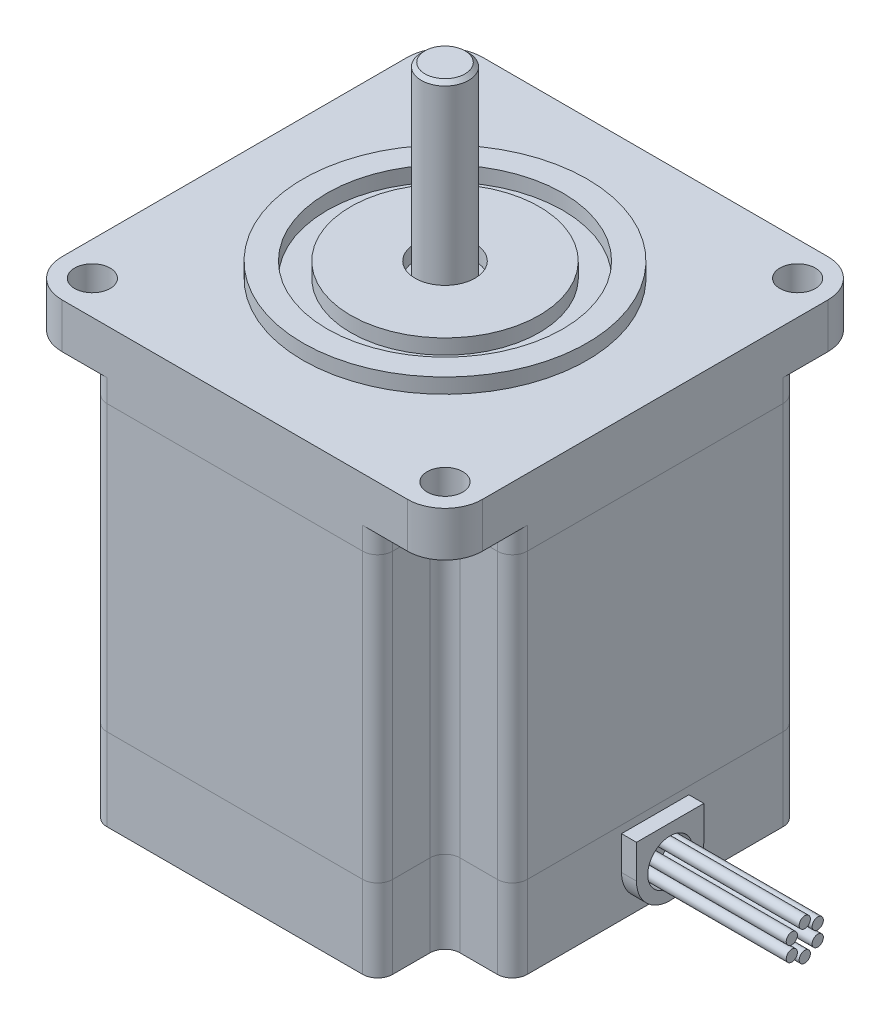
from build123d import *

# Parameters (mm, degrees)
SKETCH1_W             = 56.2
SKETCH1_H             = 56.2
SKETCH1_R             = 2.375
BOSS_EXTRUDE2_DEPTH   = 11
SKETCH2_W             = 56.2
SKETCH2_H             = 56.2
SKETCH2_R             = 2.375
BOSS_EXTRUDE3_DEPTH   = 38
SKETCH3_W             = 56.2
SKETCH3_H             = 56.2
SKETCH3_R             = 2.375
BOSS_EXTRUDE4_DEPTH   = 9
SKETCH4_R             = 3
BOSS_EXTRUDE5_DEPTH   = 2
SKETCH5_R             = 0.75
BOSS_EXTRUDE6_DEPTH   = 20
BOSS_EXTRUDE6_2_DEPTH = 20
BOSS_EXTRUDE6_3_DEPTH = 20
BOSS_EXTRUDE6_4_DEPTH = 20
BOSS_EXTRUDE6_5_DEPTH = 20
BOSS_EXTRUDE6_6_DEPTH = 20
SKETCH6_R             = 19
SKETCH6_R_2           = 15.75
SKETCH6_R_3           = 12.6
SKETCH6_R_4           = 4
BOSS_EXTRUDE7_DEPTH   = 2
SKETCH7_R             = 3.175
BOSS_EXTRUDE8_DEPTH   = 25
SKETCH11_W            = 9
SKETCH11_H            = 9
CUT_EXTRUDE1_DEPTH    = 52
FILLET1_R             = 5
FILLET2_R             = 2
FILLET3_R             = 2
CHAMFER1_SIZE         = 0.5
FILLET4_R             = 2


with BuildPart() as part:
    # Sketch1 → Boss-Extrude2 (new body)
    with BuildSketch(Plane(origin=(0, 0, 0), x_dir=(1, 0, 0), z_dir=(0, 1, 0))):
        Rectangle(SKETCH1_W, SKETCH1_H)
        with Locations(Location((23.57, 23.57, 0), (0, 0, 270))):
            Circle(SKETCH1_R, mode=Mode.SUBTRACT)
        with Locations(Location((23.57, -23.57, 0), (0, 0, 270))):
            Circle(SKETCH1_R, mode=Mode.SUBTRACT)
        with Locations(Location((-23.57, -23.57, 0), (0, 0, 270))):
            Circle(SKETCH1_R, mode=Mode.SUBTRACT)
        with Locations(Location((-23.57, 23.57, 0), (0, 0, 270))):
            Circle(SKETCH1_R, mode=Mode.SUBTRACT)
    extrude(amount=BOSS_EXTRUDE2_DEPTH)


with BuildPart() as body_2:
    # Sketch2 → Boss-Extrude3 (new body)
    with BuildSketch(Plane(origin=(0, 11, 0), x_dir=(1, 0, 0), z_dir=(0, 1, 0))):
        Rectangle(SKETCH2_W, SKETCH2_H)
        with Locations(Location((-23.57, -23.57, 0), (0, 0, 270))):
            Circle(SKETCH2_R, mode=Mode.SUBTRACT)
        with Locations(Location((23.57, -23.57, 0), (0, 0, 270))):
            Circle(SKETCH2_R, mode=Mode.SUBTRACT)
        with Locations(Location((23.57, 23.57, 0), (0, 0, 270))):
            Circle(SKETCH2_R, mode=Mode.SUBTRACT)
        with Locations(Location((-23.57, 23.57, 0), (0, 0, 270))):
            Circle(SKETCH2_R, mode=Mode.SUBTRACT)
    extrude(amount=BOSS_EXTRUDE3_DEPTH)


with BuildPart() as body_3:
    # Sketch3 → Boss-Extrude4 (new body)
    with BuildSketch(Plane(origin=(0, 49, 0), x_dir=(1, 0, 0), z_dir=(0, 1, 0))):
        Rectangle(SKETCH3_W, SKETCH3_H)
        with Locations(Location((23.57, 23.57, 0), (0, 0, 270))):
            Circle(SKETCH3_R, mode=Mode.SUBTRACT)
        with Locations(Location((23.57, -23.57, 0), (0, 0, 270))):
            Circle(SKETCH3_R, mode=Mode.SUBTRACT)
        with Locations(Location((-23.57, -23.57, 0), (0, 0, 270))):
            Circle(SKETCH3_R, mode=Mode.SUBTRACT)
        with Locations(Location((-23.57, 23.57, 0), (0, 0, 270))):
            Circle(SKETCH3_R, mode=Mode.SUBTRACT)
    extrude(amount=BOSS_EXTRUDE4_DEPTH)

    # Sketch6 → Boss-Extrude7 (add)
    # profile 1 of 2: a face of its own
    with BuildSketch(Plane(origin=(0, 58, 0), x_dir=(1, 0, 0), z_dir=(0, 1, 0))):
        with Locations(Location((0, 0, 0), (0, 0, 270))):
            Circle(SKETCH6_R)
        with Locations(Location((0, 0, 0), (0, 0, 270))):
            Circle(SKETCH6_R_2, mode=Mode.SUBTRACT)
    # profile 2 of 2: a face of its own
    with BuildSketch(Plane(origin=(0, 58, 0), x_dir=(1, 0, 0), z_dir=(0, 1, 0))):
        with Locations(Location((0, 0, 0), (0, 0, 270))):
            Circle(SKETCH6_R_3)
        with Locations(Location((0, 0, 0), (0, 0, 270))):
            Circle(SKETCH6_R_4, mode=Mode.SUBTRACT)
    extrude(amount=BOSS_EXTRUDE7_DEPTH)


with BuildPart() as body_4:
    # Sketch4 → Boss-Extrude5 (new body)
    with BuildSketch(Plane(origin=(28.1, 0, 0), x_dir=(0, 0, -1), z_dir=(1, 0, 0))):
        with BuildLine():
            Line((-4.5, 5.5), (-4.5, 10))
            Line((-4.5, 10), (4.5, 10))
            Line((4.5, 10), (4.5, 5.5))
            ThreePointArc((4.5, 5.5), (0, 1), (-4.5, 5.5))
        make_face()
        with Locations((0, 5.5)):
            Circle(SKETCH4_R, mode=Mode.SUBTRACT)
    extrude(amount=BOSS_EXTRUDE5_DEPTH)


with BuildPart() as body_5:
    # Sketch5 → Boss-Extrude6 (new body)
    with BuildSketch(Plane(origin=(28.1, 0, 0), x_dir=(0, 0, -1), z_dir=(1, 0, 0))):
        with Locations((-1.732050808, 4.5)):
            Circle(SKETCH5_R)
    extrude(amount=BOSS_EXTRUDE6_DEPTH)


with BuildPart() as body_6:
    # Sketch5 → Boss-Extrude6 2 (new body)
    with BuildSketch(Plane(origin=(28.1, 0, 0), x_dir=(0, 0, -1), z_dir=(1, 0, 0))):
        with Locations((0, 3.5)):
            Circle(SKETCH5_R)
    extrude(amount=BOSS_EXTRUDE6_2_DEPTH)


with BuildPart() as body_7:
    # Sketch5 → Boss-Extrude6 3 (new body)
    with BuildSketch(Plane(origin=(28.1, 0, 0), x_dir=(0, 0, -1), z_dir=(1, 0, 0))):
        with Locations((-1.732050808, 6.5)):
            Circle(SKETCH5_R)
    extrude(amount=BOSS_EXTRUDE6_3_DEPTH)


with BuildPart() as body_8:
    # Sketch5 → Boss-Extrude6 4 (new body)
    with BuildSketch(Plane(origin=(28.1, 0, 0), x_dir=(0, 0, -1), z_dir=(1, 0, 0))):
        with Locations((0, 7.5)):
            Circle(SKETCH5_R)
    extrude(amount=BOSS_EXTRUDE6_4_DEPTH)


with BuildPart() as body_9:
    # Sketch5 → Boss-Extrude6 5 (new body)
    with BuildSketch(Plane(origin=(28.1, 0, 0), x_dir=(0, 0, -1), z_dir=(1, 0, 0))):
        with Locations((1.732050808, 6.5)):
            Circle(SKETCH5_R)
    extrude(amount=BOSS_EXTRUDE6_5_DEPTH)


with BuildPart() as body_10:
    # Sketch5 → Boss-Extrude6 6 (new body)
    with BuildSketch(Plane(origin=(28.1, 0, 0), x_dir=(0, 0, -1), z_dir=(1, 0, 0))):
        with Locations((1.732050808, 4.5)):
            Circle(SKETCH5_R)
    extrude(amount=BOSS_EXTRUDE6_6_DEPTH)


with BuildPart() as body_11:
    # Sketch7 → Boss-Extrude8 (new body)
    with BuildSketch(Plane(origin=(0, 58, 0), x_dir=(1, 0, 0), z_dir=(0, 1, 0))):
        with Locations(Location((0, 0, 0), (0, 0, 270))):
            Circle(SKETCH7_R)
    extrude(amount=BOSS_EXTRUDE8_DEPTH)

    # Chamfer1
    chamfer1_edges = [body_11.edges().sort_by_distance(p)[0] for p in [
        (0, 83, -3.175),
    ]]
    chamfer(chamfer1_edges, length=CHAMFER1_SIZE)


with BuildPart() as cut_extrude1_tool:
    # Sketch11 → Cut-Extrude1 (new body)
    with BuildSketch(Plane.XZ):
        with Locations((-23.6, 23.6)):
            Rectangle(SKETCH11_W, SKETCH11_H)
        with Locations((23.6, 23.6)):
            Rectangle(SKETCH11_W, SKETCH11_H)
        with Locations((23.6, -23.6)):
            Rectangle(SKETCH11_W, SKETCH11_H)
        with Locations((-23.6, -23.6)):
            Rectangle(SKETCH11_W, SKETCH11_H)
    extrude(amount=-CUT_EXTRUDE1_DEPTH)


with BuildPart() as part_1:
    add(part.part)

    # Cut-Extrude1: cut by cut_extrude1_tool
    add(cut_extrude1_tool.part, mode=Mode.SUBTRACT)

    # Fillet2
    fillet2_edges = [part_1.edges().sort_by_distance(p)[0] for p in [
        (-19.1, 5.5, -28.1),
        (19.1, 5.5, -28.1),
        (28.1, 5.5, 19.1),
        (-19.1, 5.5, 28.1),
        (-19.1, 5.5, 19.1),
        (-28.1, 5.5, 19.1),
        (19.1, 5.5, 19.1),
        (19.1, 5.5, 28.1),
        (19.1, 5.5, -19.1),
        (28.1, 5.5, -19.1),
        (-19.1, 5.5, -19.1),
        (-28.1, 5.5, -19.1),
    ]]
    fillet(fillet2_edges, radius=FILLET2_R)


with BuildPart() as body_2_1:
    add(body_2.part)

    # Cut-Extrude1: cut by cut_extrude1_tool
    add(cut_extrude1_tool.part, mode=Mode.SUBTRACT)

    # Fillet3
    fillet3_edges = [body_2_1.edges().sort_by_distance(p)[0] for p in [
        (-19.1, 30, -28.1),
        (19.1, 30, -28.1),
        (28.1, 30, 19.1),
        (-19.1, 30, 28.1),
        (-19.1, 30, 19.1),
        (-28.1, 30, 19.1),
        (19.1, 30, 19.1),
        (19.1, 30, 28.1),
        (19.1, 30, -19.1),
        (28.1, 30, -19.1),
        (-28.1, 30, -19.1),
        (-19.1, 30, -19.1),
    ]]
    fillet(fillet3_edges, radius=FILLET3_R)


with BuildPart() as body_3_1:
    add(body_3.part)

    # Cut-Extrude1: cut by cut_extrude1_tool
    add(cut_extrude1_tool.part, mode=Mode.SUBTRACT)

    # Fillet1
    fillet1_edges = [body_3_1.edges().sort_by_distance(p)[0] for p in [
        (-28.1, 55, -28.1),
        (28.1, 55, -28.1),
        (28.1, 55, 28.1),
        (-28.1, 55, 28.1),
    ]]
    fillet(fillet1_edges, radius=FILLET1_R)

    # Fillet4
    fillet4_edges = [body_3_1.edges().sort_by_distance(p)[0] for p in [
        (-19.1, 50.5, 19.1),
        (-19.1, 50.5, 28.1),
        (-28.1, 50.5, 19.1),
        (19.1, 50.5, 19.1),
        (28.1, 50.5, 19.1),
        (19.1, 50.5, 28.1),
        (19.1, 50.5, -19.1),
        (19.1, 50.5, -28.1),
        (28.1, 50.5, -19.1),
        (-28.1, 50.5, -19.1),
        (-19.1, 50.5, -28.1),
        (-19.1, 50.5, -19.1),
    ]]
    fillet(fillet4_edges, radius=FILLET4_R)


solid = Compound([body_4.part, body_5.part, body_6.part, body_7.part, body_8.part, body_9.part, body_10.part, body_11.part, part_1.part, body_2_1.part, body_3_1.part])
